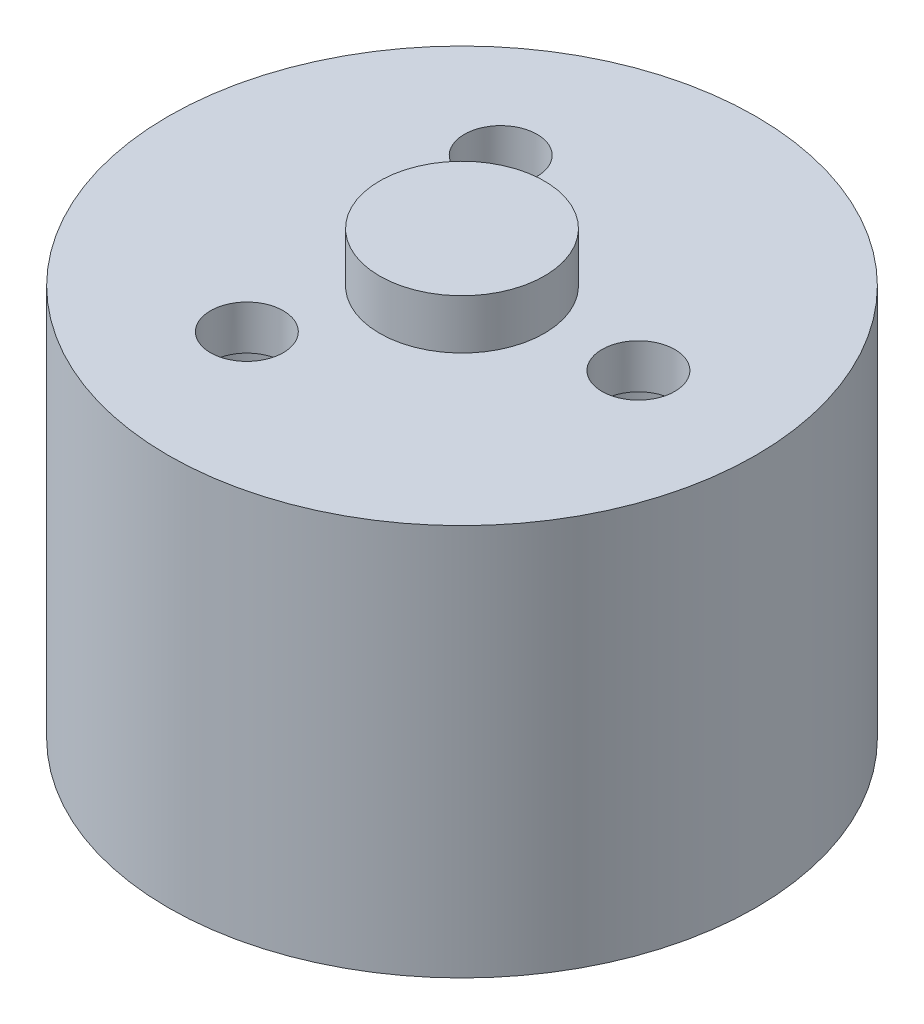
ISO-10303-21;
HEADER;
FILE_DESCRIPTION(('STEP AP214'),'2;1');
FILE_NAME('part.step','',(''),(''),'','','');
FILE_SCHEMA(('AUTOMOTIVE_DESIGN { 1 0 10303 214 1 1 1 1 }'));
ENDSEC;
DATA;
#1=APPLICATION_CONTEXT('core data for automotive mechanical design processes');
#2=APPLICATION_PROTOCOL_DEFINITION('international standard','automotive_design',2000,#1);
#3=PRODUCT_CONTEXT('',#1,'mechanical');
#4=PRODUCT('Part','Part','',(#3));
#5=PRODUCT_RELATED_PRODUCT_CATEGORY('part','',(#4));
#6=PRODUCT_DEFINITION_FORMATION('','',#4);
#7=PRODUCT_DEFINITION_CONTEXT('part definition',#1,'design');
#8=PRODUCT_DEFINITION('design','',#6,#7);
#9=PRODUCT_DEFINITION_SHAPE('','',#8);
#10=(LENGTH_UNIT() NAMED_UNIT(*) SI_UNIT(.MILLI.,.METRE.));
#11=(NAMED_UNIT(*) PLANE_ANGLE_UNIT() SI_UNIT($,.RADIAN.));
#12=(NAMED_UNIT(*) SI_UNIT($,.STERADIAN.) SOLID_ANGLE_UNIT());
#13=UNCERTAINTY_MEASURE_WITH_UNIT(LENGTH_MEASURE(1.E-05),#10,'distance_accuracy_value','');
#14=(GEOMETRIC_REPRESENTATION_CONTEXT(3) GLOBAL_UNCERTAINTY_ASSIGNED_CONTEXT((#13)) GLOBAL_UNIT_ASSIGNED_CONTEXT((#10,
#11,#12)) REPRESENTATION_CONTEXT('',''));
#15=CARTESIAN_POINT('',(0.,0.,0.));
#16=DIRECTION('',(0.,0.,1.));
#17=DIRECTION('',(1.,0.,0.));
#18=AXIS2_PLACEMENT_3D('',#15,#16,#17);
#19=CARTESIAN_POINT('',(0.,11.83716,0.));
#20=DIRECTION('',(0.,1.,0.));
#21=DIRECTION('',(0.,0.,1.));
#22=AXIS2_PLACEMENT_3D('',#19,#20,#21);
#23=PLANE('',#22);
#24=CARTESIAN_POINT('',(-2.83009570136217,11.83716,-4.0000697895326));
#25=DIRECTION('',(0.,1.,0.));
#26=DIRECTION('',(0.866025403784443,0.,-0.499999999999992));
#27=AXIS2_PLACEMENT_3D('',#24,#25,#26);
#28=CIRCLE('',#27,1.1);
#29=CARTESIAN_POINT('',(-1.87746775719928,11.83716,-4.55006978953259));
#30=VERTEX_POINT('',#29);
#31=EDGE_CURVE('E124',#30,#30,#28,.T.);
#32=ORIENTED_EDGE('',*,*,#31,.F.);
#33=EDGE_LOOP('',(#32));
#34=FACE_BOUND('',#33,.T.);
#35=CARTESIAN_POINT('',(-2.04911420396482,11.83716,4.45096966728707));
#36=DIRECTION('',(0.,1.,0.));
#37=DIRECTION('',(-0.866025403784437,0.,-0.500000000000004));
#38=AXIS2_PLACEMENT_3D('',#35,#36,#37);
#39=CIRCLE('',#38,1.1);
#40=CARTESIAN_POINT('',(-3.0017421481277,11.83716,3.90096966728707));
#41=VERTEX_POINT('',#40);
#42=EDGE_CURVE('E140',#41,#41,#39,.T.);
#43=ORIENTED_EDGE('',*,*,#42,.F.);
#44=EDGE_LOOP('',(#43));
#45=FACE_BOUND('',#44,.T.);
#46=CARTESIAN_POINT('',(4.87920990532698,11.83716,-0.45089987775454));
#47=DIRECTION('',(0.,1.,0.));
#48=DIRECTION('',(0.,0.,1.));
#49=AXIS2_PLACEMENT_3D('',#46,#47,#48);
#50=CIRCLE('',#49,1.1);
#51=CARTESIAN_POINT('',(4.87920990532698,11.83716,0.649100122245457));
#52=VERTEX_POINT('',#51);
#53=EDGE_CURVE('E48',#52,#52,#50,.T.);
#54=ORIENTED_EDGE('',*,*,#53,.F.);
#55=EDGE_LOOP('',(#54));
#56=FACE_BOUND('',#55,.T.);
#57=CARTESIAN_POINT('',(0.,11.83716,0.));
#58=DIRECTION('',(0.,1.,0.));
#59=DIRECTION('',(0.,0.,1.));
#60=AXIS2_PLACEMENT_3D('',#57,#58,#59);
#61=CIRCLE('',#60,8.875);
#62=CARTESIAN_POINT('',(0.,11.83716,-8.875));
#63=VERTEX_POINT('',#62);
#64=EDGE_CURVE('E11',#63,#63,#61,.T.);
#65=ORIENTED_EDGE('',*,*,#64,.T.);
#66=EDGE_LOOP('',(#65));
#67=FACE_BOUND('',#66,.T.);
#68=CARTESIAN_POINT('',(0.,11.83716,0.));
#69=DIRECTION('',(0.,1.,0.));
#70=DIRECTION('',(0.,0.,1.));
#71=AXIS2_PLACEMENT_3D('',#68,#69,#70);
#72=CIRCLE('',#71,2.4892);
#73=CARTESIAN_POINT('',(0.,11.83716,2.4892));
#74=VERTEX_POINT('',#73);
#75=EDGE_CURVE('E168',#74,#74,#72,.T.);
#76=ORIENTED_EDGE('',*,*,#75,.F.);
#77=EDGE_LOOP('',(#76));
#78=FACE_BOUND('',#77,.T.);
#79=ADVANCED_FACE('F44',(#34,#45,#56,#67,#78),#23,.T.);
#80=CARTESIAN_POINT('',(0.,11.83716,0.));
#81=DIRECTION('',(0.,-1.,0.));
#82=DIRECTION('',(0.,0.,-1.));
#83=AXIS2_PLACEMENT_3D('',#80,#81,#82);
#84=CYLINDRICAL_SURFACE('',#83,8.875);
#85=CARTESIAN_POINT('',(0.,0.,0.));
#86=DIRECTION('',(0.,1.,0.));
#87=DIRECTION('',(0.,0.,1.));
#88=AXIS2_PLACEMENT_3D('',#85,#86,#87);
#89=CIRCLE('',#88,8.875);
#90=CARTESIAN_POINT('',(0.,0.,-8.875));
#91=VERTEX_POINT('',#90);
#92=EDGE_CURVE('E54',#91,#91,#89,.T.);
#93=CARTESIAN_POINT('',(0.,11.83716,-8.875));
#94=CARTESIAN_POINT('',(0.,11.71385625,-8.875));
#95=CARTESIAN_POINT('',(0.,11.5905525,-8.875));
#96=CARTESIAN_POINT('',(0.,11.343945,-8.875));
#97=CARTESIAN_POINT('',(0.,11.22064125,-8.875));
#98=CARTESIAN_POINT('',(0.,10.97403375,-8.875));
#99=CARTESIAN_POINT('',(0.,10.85073,-8.875));
#100=CARTESIAN_POINT('',(0.,10.6041225,-8.875));
#101=CARTESIAN_POINT('',(0.,10.48081875,-8.875));
#102=CARTESIAN_POINT('',(0.,10.23421125,-8.875));
#103=CARTESIAN_POINT('',(0.,10.1109075,-8.875));
#104=CARTESIAN_POINT('',(0.,9.8643,-8.875));
#105=CARTESIAN_POINT('',(0.,9.74099625,-8.875));
#106=CARTESIAN_POINT('',(0.,9.49438875,-8.875));
#107=CARTESIAN_POINT('',(0.,9.371085,-8.875));
#108=CARTESIAN_POINT('',(0.,9.1244775,-8.875));
#109=CARTESIAN_POINT('',(0.,9.00117375,-8.875));
#110=CARTESIAN_POINT('',(0.,8.75456625,-8.875));
#111=CARTESIAN_POINT('',(0.,8.6312625,-8.875));
#112=CARTESIAN_POINT('',(0.,8.384655,-8.875));
#113=CARTESIAN_POINT('',(0.,8.26135125,-8.875));
#114=CARTESIAN_POINT('',(0.,8.01474375,-8.875));
#115=CARTESIAN_POINT('',(0.,7.89144,-8.875));
#116=CARTESIAN_POINT('',(0.,7.6448325,-8.875));
#117=CARTESIAN_POINT('',(0.,7.52152875,-8.875));
#118=CARTESIAN_POINT('',(0.,7.27492125,-8.875));
#119=CARTESIAN_POINT('',(0.,7.1516175,-8.875));
#120=CARTESIAN_POINT('',(0.,6.90501,-8.875));
#121=CARTESIAN_POINT('',(0.,6.78170625,-8.875));
#122=CARTESIAN_POINT('',(0.,6.53509875,-8.875));
#123=CARTESIAN_POINT('',(0.,6.411795,-8.875));
#124=CARTESIAN_POINT('',(0.,6.1651875,-8.875));
#125=CARTESIAN_POINT('',(0.,6.04188375,-8.875));
#126=CARTESIAN_POINT('',(0.,5.79527625,-8.875));
#127=CARTESIAN_POINT('',(0.,5.6719725,-8.875));
#128=CARTESIAN_POINT('',(0.,5.425365,-8.875));
#129=CARTESIAN_POINT('',(0.,5.30206125,-8.875));
#130=CARTESIAN_POINT('',(0.,5.05545375,-8.875));
#131=CARTESIAN_POINT('',(0.,4.93215,-8.875));
#132=CARTESIAN_POINT('',(0.,4.6855425,-8.875));
#133=CARTESIAN_POINT('',(0.,4.56223875,-8.875));
#134=CARTESIAN_POINT('',(0.,4.31563125,-8.875));
#135=CARTESIAN_POINT('',(0.,4.1923275,-8.875));
#136=CARTESIAN_POINT('',(0.,3.94572,-8.875));
#137=CARTESIAN_POINT('',(0.,3.82241625,-8.875));
#138=CARTESIAN_POINT('',(0.,3.57580875,-8.875));
#139=CARTESIAN_POINT('',(0.,3.452505,-8.875));
#140=CARTESIAN_POINT('',(0.,3.2058975,-8.875));
#141=CARTESIAN_POINT('',(0.,3.08259375,-8.875));
#142=CARTESIAN_POINT('',(0.,2.83598625,-8.875));
#143=CARTESIAN_POINT('',(0.,2.7126825,-8.875));
#144=CARTESIAN_POINT('',(0.,2.466075,-8.875));
#145=CARTESIAN_POINT('',(0.,2.34277125,-8.875));
#146=CARTESIAN_POINT('',(0.,2.09616375,-8.875));
#147=CARTESIAN_POINT('',(0.,1.97286,-8.875));
#148=CARTESIAN_POINT('',(0.,1.7262525,-8.875));
#149=CARTESIAN_POINT('',(0.,1.60294875,-8.875));
#150=CARTESIAN_POINT('',(0.,1.35634125,-8.875));
#151=CARTESIAN_POINT('',(0.,1.2330375,-8.875));
#152=CARTESIAN_POINT('',(0.,0.986429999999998,-8.875));
#153=CARTESIAN_POINT('',(0.,0.863126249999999,-8.875));
#154=CARTESIAN_POINT('',(0.,0.616518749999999,-8.875));
#155=CARTESIAN_POINT('',(0.,0.493214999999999,-8.875));
#156=CARTESIAN_POINT('',(0.,0.246607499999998,-8.875));
#157=CARTESIAN_POINT('',(0.,0.123303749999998,-8.875));
#158=CARTESIAN_POINT('',(0.,0.,-8.875));
#159=B_SPLINE_CURVE_WITH_KNOTS('',3,(#93,#94,#95,#96,#97,#98,#99,#100,#101,#102,#103,#104,#105,
#106,#107,#108,#109,#110,#111,#112,#113,#114,#115,#116,#117,#118,#119,#120,#121,#122,#123,#124,
#125,#126,#127,#128,#129,#130,#131,#132,#133,#134,#135,#136,#137,#138,#139,#140,#141,#142,#143,
#144,#145,#146,#147,#148,#149,#150,#151,#152,#153,#154,#155,#156,#157,#158),.UNSPECIFIED.,.F.,
.F.,(4,2,2,2,2,2,2,2,2,2,2,2,2,2,2,2,2,2,2,2,2,2,2,2,2,2,2,2,2,2,2,2,4),(0.,0.36991125,
0.739822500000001,1.10973375,1.479645,1.84955625,2.2194675,2.58937875,2.95929,3.32920125,
3.6991125,4.06902375,4.438935,4.80884625,5.1787575,5.54866875,5.91858,6.28849125,6.6584025,
7.02831375,7.398225,7.76813625,8.1380475,8.50795875,8.87787,9.24778125,9.6176925,9.98760375,
10.357515,10.72742625,11.0973375,11.46724875,11.83716),.UNSPECIFIED.);
#160=EDGE_CURVE('BSEAM46',#63,#91,#159,.T.);
#161=ORIENTED_EDGE('',*,*,#64,.F.);
#162=ORIENTED_EDGE('',*,*,#92,.T.);
#163=ORIENTED_EDGE('',*,*,#160,.T.);
#164=ORIENTED_EDGE('',*,*,#160,.F.);
#165=EDGE_LOOP('',(#161,#163,#162,#164));
#166=FACE_BOUND('',#165,.T.);
#167=ADVANCED_FACE('F46',(#166),#84,.T.);
#168=CARTESIAN_POINT('',(0.,0.,0.));
#169=DIRECTION('',(0.,1.,0.));
#170=DIRECTION('',(0.,0.,1.));
#171=AXIS2_PLACEMENT_3D('',#168,#169,#170);
#172=PLANE('',#171);
#173=CARTESIAN_POINT('',(2.04911420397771,0.,-4.45096966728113));
#174=DIRECTION('',(0.,-1.,0.));
#175=DIRECTION('',(-0.866025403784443,0.,0.499999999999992));
#176=AXIS2_PLACEMENT_3D('',#173,#174,#175);
#177=CIRCLE('',#176,1.);
#178=CARTESIAN_POINT('',(1.18308880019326,0.,-3.95096966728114));
#179=VERTEX_POINT('',#178);
#180=EDGE_CURVE('E297',#179,#179,#177,.T.);
#181=ORIENTED_EDGE('',*,*,#180,.F.);
#182=EDGE_LOOP('',(#181));
#183=FACE_BOUND('',#182,.T.);
#184=CARTESIAN_POINT('',(-4.87920990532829,0.,0.450899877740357));
#185=DIRECTION('',(0.,-1.,0.));
#186=DIRECTION('',(0.866025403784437,0.,0.500000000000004));
#187=AXIS2_PLACEMENT_3D('',#184,#185,#186);
#188=CIRCLE('',#187,1.);
#189=CARTESIAN_POINT('',(-4.01318450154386,0.,0.950899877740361));
#190=VERTEX_POINT('',#189);
#191=EDGE_CURVE('E79',#190,#190,#188,.T.);
#192=ORIENTED_EDGE('',*,*,#191,.F.);
#193=EDGE_LOOP('',(#192));
#194=FACE_BOUND('',#193,.T.);
#195=CARTESIAN_POINT('',(2.83009570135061,0.,4.00006978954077));
#196=DIRECTION('',(0.,-1.,0.));
#197=DIRECTION('',(0.,0.,-1.));
#198=AXIS2_PLACEMENT_3D('',#195,#196,#197);
#199=CIRCLE('',#198,1.);
#200=CARTESIAN_POINT('',(2.83009570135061,0.,3.00006978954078));
#201=VERTEX_POINT('',#200);
#202=EDGE_CURVE('E104',#201,#201,#199,.T.);
#203=ORIENTED_EDGE('',*,*,#202,.F.);
#204=EDGE_LOOP('',(#203));
#205=FACE_BOUND('',#204,.T.);
#206=CARTESIAN_POINT('',(-2.83009570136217,0.,-4.00006978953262));
#207=DIRECTION('',(0.,-1.,0.));
#208=DIRECTION('',(-0.866025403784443,0.,0.499999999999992));
#209=AXIS2_PLACEMENT_3D('',#206,#207,#208);
#210=CIRCLE('',#209,2.19999999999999);
#211=CARTESIAN_POINT('',(-4.73535158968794,0.,-2.90006978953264));
#212=VERTEX_POINT('',#211);
#213=EDGE_CURVE('E120',#212,#212,#210,.T.);
#214=ORIENTED_EDGE('',*,*,#213,.F.);
#215=EDGE_LOOP('',(#214));
#216=FACE_BOUND('',#215,.T.);
#217=CARTESIAN_POINT('',(-2.04911420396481,0.,4.45096966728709));
#218=DIRECTION('',(0.,-1.,0.));
#219=DIRECTION('',(0.866025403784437,0.,0.500000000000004));
#220=AXIS2_PLACEMENT_3D('',#217,#218,#219);
#221=CIRCLE('',#220,2.19999999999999);
#222=CARTESIAN_POINT('',(-0.143858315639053,0.,5.55096966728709));
#223=VERTEX_POINT('',#222);
#224=EDGE_CURVE('E136',#223,#223,#221,.T.);
#225=ORIENTED_EDGE('',*,*,#224,.F.);
#226=EDGE_LOOP('',(#225));
#227=FACE_BOUND('',#226,.T.);
#228=CARTESIAN_POINT('',(4.87920990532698,0.,-0.450899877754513));
#229=DIRECTION('',(0.,-1.,0.));
#230=DIRECTION('',(0.,0.,-1.));
#231=AXIS2_PLACEMENT_3D('',#228,#229,#230);
#232=CIRCLE('',#231,2.19999999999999);
#233=CARTESIAN_POINT('',(4.87920990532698,0.,-2.65089987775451));
#234=VERTEX_POINT('',#233);
#235=EDGE_CURVE('E152',#234,#234,#232,.T.);
#236=ORIENTED_EDGE('',*,*,#235,.F.);
#237=EDGE_LOOP('',(#236));
#238=FACE_BOUND('',#237,.T.);
#239=CARTESIAN_POINT('',(0.,0.,0.));
#240=DIRECTION('',(0.,-1.,0.));
#241=DIRECTION('',(0.,0.,-1.));
#242=AXIS2_PLACEMENT_3D('',#239,#240,#241);
#243=CIRCLE('',#242,2.4892);
#244=CARTESIAN_POINT('',(0.,0.,-2.4892));
#245=VERTEX_POINT('',#244);
#246=EDGE_CURVE('E169',#245,#245,#243,.T.);
#247=ORIENTED_EDGE('',*,*,#246,.F.);
#248=EDGE_LOOP('',(#247));
#249=FACE_BOUND('',#248,.T.);
#250=ORIENTED_EDGE('',*,*,#92,.F.);
#251=EDGE_LOOP('',(#250));
#252=FACE_BOUND('',#251,.T.);
#253=ADVANCED_FACE('F184',(#183,#194,#205,#216,#227,#238,#249,#252),#172,.F.);
#254=CARTESIAN_POINT('',(0.,13.33716,0.));
#255=DIRECTION('',(0.,-1.,0.));
#256=DIRECTION('',(0.,0.,-1.));
#257=AXIS2_PLACEMENT_3D('',#254,#255,#256);
#258=CYLINDRICAL_SURFACE('',#257,2.4892);
#259=CARTESIAN_POINT('',(0.,13.33716,0.));
#260=DIRECTION('',(0.,1.,0.));
#261=DIRECTION('',(0.,0.,1.));
#262=AXIS2_PLACEMENT_3D('',#259,#260,#261);
#263=CIRCLE('',#262,2.4892);
#264=CARTESIAN_POINT('',(0.,13.33716,2.4892));
#265=VERTEX_POINT('',#264);
#266=EDGE_CURVE('E173',#265,#265,#263,.T.);
#267=ORIENTED_EDGE('',*,*,#266,.F.);
#268=EDGE_LOOP('',(#267));
#269=FACE_BOUND('',#268,.T.);
#270=ORIENTED_EDGE('',*,*,#75,.T.);
#271=EDGE_LOOP('',(#270));
#272=FACE_BOUND('',#271,.T.);
#273=ADVANCED_FACE('F186',(#269,#272),#258,.T.);
#274=CARTESIAN_POINT('',(0.,13.33716,0.));
#275=DIRECTION('',(0.,1.,0.));
#276=DIRECTION('',(0.,0.,1.));
#277=AXIS2_PLACEMENT_3D('',#274,#275,#276);
#278=PLANE('',#277);
#279=ORIENTED_EDGE('',*,*,#266,.T.);
#280=EDGE_LOOP('',(#279));
#281=FACE_BOUND('',#280,.T.);
#282=ADVANCED_FACE('F192',(#281),#278,.T.);
#283=CARTESIAN_POINT('',(0.,1.5,0.));
#284=DIRECTION('',(0.,-1.,0.));
#285=DIRECTION('',(0.,0.,-1.));
#286=AXIS2_PLACEMENT_3D('',#283,#284,#285);
#287=CYLINDRICAL_SURFACE('',#286,2.4892);
#288=CARTESIAN_POINT('',(0.,1.5,0.));
#289=DIRECTION('',(0.,-1.,0.));
#290=DIRECTION('',(0.,0.,-1.));
#291=AXIS2_PLACEMENT_3D('',#288,#289,#290);
#292=CIRCLE('',#291,2.4892);
#293=CARTESIAN_POINT('',(0.,1.5,-2.48920000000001));
#294=VERTEX_POINT('',#293);
#295=EDGE_CURVE('E164',#294,#294,#292,.T.);
#296=ORIENTED_EDGE('',*,*,#295,.F.);
#297=EDGE_LOOP('',(#296));
#298=FACE_BOUND('',#297,.T.);
#299=ORIENTED_EDGE('',*,*,#246,.T.);
#300=EDGE_LOOP('',(#299));
#301=FACE_BOUND('',#300,.T.);
#302=ADVANCED_FACE('F208',(#298,#301),#287,.F.);
#303=CARTESIAN_POINT('',(0.,1.5,0.));
#304=DIRECTION('',(0.,-1.,0.));
#305=DIRECTION('',(0.,0.,-1.));
#306=AXIS2_PLACEMENT_3D('',#303,#304,#305);
#307=PLANE('',#306);
#308=ORIENTED_EDGE('',*,*,#295,.T.);
#309=EDGE_LOOP('',(#308));
#310=FACE_BOUND('',#309,.T.);
#311=ADVANCED_FACE('F212',(#310),#307,.T.);
#312=CARTESIAN_POINT('',(4.87920990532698,0.,-0.450899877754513));
#313=DIRECTION('',(0.,-1.,0.));
#314=DIRECTION('',(0.,0.,-1.));
#315=AXIS2_PLACEMENT_3D('',#312,#313,#314);
#316=CYLINDRICAL_SURFACE('',#315,1.1);
#317=ORIENTED_EDGE('',*,*,#53,.T.);
#318=EDGE_LOOP('',(#317));
#319=FACE_BOUND('',#318,.T.);
#320=CARTESIAN_POINT('',(4.87920990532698,10.5,-0.45089987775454));
#321=DIRECTION('',(0.,-1.,0.));
#322=DIRECTION('',(0.,0.,-1.));
#323=AXIS2_PLACEMENT_3D('',#320,#321,#322);
#324=CIRCLE('',#323,1.1);
#325=CARTESIAN_POINT('',(4.87920990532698,10.5,-1.55089987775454));
#326=VERTEX_POINT('',#325);
#327=EDGE_CURVE('E160',#326,#326,#324,.T.);
#328=ORIENTED_EDGE('',*,*,#327,.T.);
#329=EDGE_LOOP('',(#328));
#330=FACE_BOUND('',#329,.T.);
#331=ADVANCED_FACE('F216',(#319,#330),#316,.F.);
#332=CARTESIAN_POINT('',(5.97920990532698,10.5,-0.45089987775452));
#333=DIRECTION('',(0.,1.,0.));
#334=DIRECTION('',(0.,0.,1.));
#335=AXIS2_PLACEMENT_3D('',#332,#333,#334);
#336=PLANE('',#335);
#337=ORIENTED_EDGE('',*,*,#327,.F.);
#338=EDGE_LOOP('',(#337));
#339=FACE_BOUND('',#338,.T.);
#340=CARTESIAN_POINT('',(4.87920990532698,10.5,-0.45089987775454));
#341=DIRECTION('',(0.,-1.,0.));
#342=DIRECTION('',(0.,0.,-1.));
#343=AXIS2_PLACEMENT_3D('',#340,#341,#342);
#344=CIRCLE('',#343,2.2);
#345=CARTESIAN_POINT('',(4.87920990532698,10.5,-2.65089987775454));
#346=VERTEX_POINT('',#345);
#347=EDGE_CURVE('E156',#346,#346,#344,.T.);
#348=ORIENTED_EDGE('',*,*,#347,.T.);
#349=EDGE_LOOP('',(#348));
#350=FACE_BOUND('',#349,.T.);
#351=ADVANCED_FACE('F220',(#339,#350),#336,.F.);
#352=CARTESIAN_POINT('',(4.87920990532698,0.,-0.450899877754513));
#353=DIRECTION('',(0.,-1.,0.));
#354=DIRECTION('',(0.,0.,-1.));
#355=AXIS2_PLACEMENT_3D('',#352,#353,#354);
#356=CYLINDRICAL_SURFACE('',#355,2.2);
#357=ORIENTED_EDGE('',*,*,#347,.F.);
#358=EDGE_LOOP('',(#357));
#359=FACE_BOUND('',#358,.T.);
#360=ORIENTED_EDGE('',*,*,#235,.T.);
#361=EDGE_LOOP('',(#360));
#362=FACE_BOUND('',#361,.T.);
#363=ADVANCED_FACE('F224',(#359,#362),#356,.F.);
#364=CARTESIAN_POINT('',(-2.04911420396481,0.,4.45096966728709));
#365=DIRECTION('',(0.,-1.,0.));
#366=DIRECTION('',(0.866025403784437,0.,0.500000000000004));
#367=AXIS2_PLACEMENT_3D('',#364,#365,#366);
#368=CYLINDRICAL_SURFACE('',#367,1.1);
#369=ORIENTED_EDGE('',*,*,#42,.T.);
#370=EDGE_LOOP('',(#369));
#371=FACE_BOUND('',#370,.T.);
#372=CARTESIAN_POINT('',(-2.04911420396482,10.5,4.45096966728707));
#373=DIRECTION('',(0.,-1.,0.));
#374=DIRECTION('',(0.866025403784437,0.,0.500000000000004));
#375=AXIS2_PLACEMENT_3D('',#372,#373,#374);
#376=CIRCLE('',#375,1.1);
#377=CARTESIAN_POINT('',(-1.09648625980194,10.5,5.00096966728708));
#378=VERTEX_POINT('',#377);
#379=EDGE_CURVE('E148',#378,#378,#376,.T.);
#380=ORIENTED_EDGE('',*,*,#379,.T.);
#381=EDGE_LOOP('',(#380));
#382=FACE_BOUND('',#381,.T.);
#383=ADVANCED_FACE('F228',(#371,#382),#368,.F.);
#384=CARTESIAN_POINT('',(-2.59911420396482,10.5,5.40359761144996));
#385=DIRECTION('',(0.,1.,0.));
#386=DIRECTION('',(-0.866025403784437,0.,-0.500000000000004));
#387=AXIS2_PLACEMENT_3D('',#384,#385,#386);
#388=PLANE('',#387);
#389=ORIENTED_EDGE('',*,*,#379,.F.);
#390=EDGE_LOOP('',(#389));
#391=FACE_BOUND('',#390,.T.);
#392=CARTESIAN_POINT('',(-2.04911420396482,10.5,4.45096966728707));
#393=DIRECTION('',(0.,-1.,0.));
#394=DIRECTION('',(0.866025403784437,0.,0.500000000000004));
#395=AXIS2_PLACEMENT_3D('',#392,#393,#394);
#396=CIRCLE('',#395,2.2);
#397=CARTESIAN_POINT('',(-0.143858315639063,10.5,5.55096966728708));
#398=VERTEX_POINT('',#397);
#399=EDGE_CURVE('E144',#398,#398,#396,.T.);
#400=ORIENTED_EDGE('',*,*,#399,.T.);
#401=EDGE_LOOP('',(#400));
#402=FACE_BOUND('',#401,.T.);
#403=ADVANCED_FACE('F233',(#391,#402),#388,.F.);
#404=CARTESIAN_POINT('',(-2.04911420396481,0.,4.45096966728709));
#405=DIRECTION('',(0.,-1.,0.));
#406=DIRECTION('',(0.866025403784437,0.,0.500000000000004));
#407=AXIS2_PLACEMENT_3D('',#404,#405,#406);
#408=CYLINDRICAL_SURFACE('',#407,2.2);
#409=ORIENTED_EDGE('',*,*,#399,.F.);
#410=EDGE_LOOP('',(#409));
#411=FACE_BOUND('',#410,.T.);
#412=ORIENTED_EDGE('',*,*,#224,.T.);
#413=EDGE_LOOP('',(#412));
#414=FACE_BOUND('',#413,.T.);
#415=ADVANCED_FACE('F230',(#411,#414),#408,.F.);
#416=CARTESIAN_POINT('',(-2.83009570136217,0.,-4.00006978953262));
#417=DIRECTION('',(0.,-1.,0.));
#418=DIRECTION('',(-0.866025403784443,0.,0.499999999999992));
#419=AXIS2_PLACEMENT_3D('',#416,#417,#418);
#420=CYLINDRICAL_SURFACE('',#419,1.1);
#421=ORIENTED_EDGE('',*,*,#31,.T.);
#422=EDGE_LOOP('',(#421));
#423=FACE_BOUND('',#422,.T.);
#424=CARTESIAN_POINT('',(-2.83009570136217,10.5,-4.0000697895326));
#425=DIRECTION('',(0.,-1.,0.));
#426=DIRECTION('',(-0.866025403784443,0.,0.499999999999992));
#427=AXIS2_PLACEMENT_3D('',#424,#425,#426);
#428=CIRCLE('',#427,1.1);
#429=CARTESIAN_POINT('',(-3.78272364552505,10.5,-3.45006978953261));
#430=VERTEX_POINT('',#429);
#431=EDGE_CURVE('E132',#430,#430,#428,.T.);
#432=ORIENTED_EDGE('',*,*,#431,.T.);
#433=EDGE_LOOP('',(#432));
#434=FACE_BOUND('',#433,.T.);
#435=ADVANCED_FACE('F241',(#423,#434),#420,.F.);
#436=CARTESIAN_POINT('',(-3.38009570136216,10.5,-4.95269773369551));
#437=DIRECTION('',(0.,1.,0.));
#438=DIRECTION('',(0.866025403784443,0.,-0.499999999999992));
#439=AXIS2_PLACEMENT_3D('',#436,#437,#438);
#440=PLANE('',#439);
#441=ORIENTED_EDGE('',*,*,#431,.F.);
#442=EDGE_LOOP('',(#441));
#443=FACE_BOUND('',#442,.T.);
#444=CARTESIAN_POINT('',(-2.83009570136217,10.5,-4.0000697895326));
#445=DIRECTION('',(0.,-1.,0.));
#446=DIRECTION('',(-0.866025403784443,0.,0.499999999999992));
#447=AXIS2_PLACEMENT_3D('',#444,#445,#446);
#448=CIRCLE('',#447,2.2);
#449=CARTESIAN_POINT('',(-4.73535158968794,10.5,-2.90006978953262));
#450=VERTEX_POINT('',#449);
#451=EDGE_CURVE('E128',#450,#450,#448,.T.);
#452=ORIENTED_EDGE('',*,*,#451,.T.);
#453=EDGE_LOOP('',(#452));
#454=FACE_BOUND('',#453,.T.);
#455=ADVANCED_FACE('F245',(#443,#454),#440,.F.);
#456=CARTESIAN_POINT('',(-2.83009570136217,0.,-4.00006978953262));
#457=DIRECTION('',(0.,-1.,0.));
#458=DIRECTION('',(-0.866025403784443,0.,0.499999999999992));
#459=AXIS2_PLACEMENT_3D('',#456,#457,#458);
#460=CYLINDRICAL_SURFACE('',#459,2.2);
#461=ORIENTED_EDGE('',*,*,#451,.F.);
#462=EDGE_LOOP('',(#461));
#463=FACE_BOUND('',#462,.T.);
#464=ORIENTED_EDGE('',*,*,#213,.T.);
#465=EDGE_LOOP('',(#464));
#466=FACE_BOUND('',#465,.T.);
#467=ADVANCED_FACE('F235',(#463,#466),#460,.F.);
#468=CARTESIAN_POINT('',(2.83009570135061,6.2,4.00006978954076));
#469=DIRECTION('',(0.,-1.,0.));
#470=DIRECTION('',(0.,0.,-1.));
#471=AXIS2_PLACEMENT_3D('',#468,#469,#470);
#472=CONICAL_SURFACE('',#471,0.799999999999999,1.02974425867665);
#473=CARTESIAN_POINT('',(2.83009570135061,6.68068849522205,4.00006978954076));
#474=VERTEX_POINT('',#473);
#475=VERTEX_LOOP('',#474);
#476=FACE_BOUND('',#475,.T.);
#477=CARTESIAN_POINT('',(2.83009570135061,6.2,4.00006978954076));
#478=DIRECTION('',(0.,-1.,0.));
#479=DIRECTION('',(0.,0.,-1.));
#480=AXIS2_PLACEMENT_3D('',#477,#478,#479);
#481=CIRCLE('',#480,0.799999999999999);
#482=CARTESIAN_POINT('',(2.83009570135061,6.2,3.20006978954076));
#483=VERTEX_POINT('',#482);
#484=EDGE_CURVE('E116',#483,#483,#481,.T.);
#485=ORIENTED_EDGE('',*,*,#484,.T.);
#486=EDGE_LOOP('',(#485));
#487=FACE_BOUND('',#486,.T.);
#488=ADVANCED_FACE('F247',(#476,#487),#472,.F.);
#489=CARTESIAN_POINT('',(2.83009570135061,0.,4.00006978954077));
#490=DIRECTION('',(0.,-1.,0.));
#491=DIRECTION('',(0.,0.,-1.));
#492=AXIS2_PLACEMENT_3D('',#489,#490,#491);
#493=CYLINDRICAL_SURFACE('',#492,0.799999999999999);
#494=ORIENTED_EDGE('',*,*,#484,.F.);
#495=EDGE_LOOP('',(#494));
#496=FACE_BOUND('',#495,.T.);
#497=CARTESIAN_POINT('',(2.83009570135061,5.,4.00006978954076));
#498=DIRECTION('',(0.,-1.,0.));
#499=DIRECTION('',(0.,0.,-1.));
#500=AXIS2_PLACEMENT_3D('',#497,#498,#499);
#501=CIRCLE('',#500,0.799999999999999);
#502=CARTESIAN_POINT('',(2.83009570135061,5.,3.20006978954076));
#503=VERTEX_POINT('',#502);
#504=EDGE_CURVE('E112',#503,#503,#501,.T.);
#505=ORIENTED_EDGE('',*,*,#504,.T.);
#506=EDGE_LOOP('',(#505));
#507=FACE_BOUND('',#506,.T.);
#508=ADVANCED_FACE('F256',(#496,#507),#493,.F.);
#509=CARTESIAN_POINT('',(3.63009570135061,5.,4.00006978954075));
#510=DIRECTION('',(0.,1.,0.));
#511=DIRECTION('',(0.,0.,1.));
#512=AXIS2_PLACEMENT_3D('',#509,#510,#511);
#513=PLANE('',#512);
#514=ORIENTED_EDGE('',*,*,#504,.F.);
#515=EDGE_LOOP('',(#514));
#516=FACE_BOUND('',#515,.T.);
#517=CARTESIAN_POINT('',(2.83009570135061,5.,4.00006978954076));
#518=DIRECTION('',(0.,-1.,0.));
#519=DIRECTION('',(0.,0.,-1.));
#520=AXIS2_PLACEMENT_3D('',#517,#518,#519);
#521=CIRCLE('',#520,0.999999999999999);
#522=CARTESIAN_POINT('',(2.83009570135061,5.,3.00006978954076));
#523=VERTEX_POINT('',#522);
#524=EDGE_CURVE('E108',#523,#523,#521,.T.);
#525=ORIENTED_EDGE('',*,*,#524,.T.);
#526=EDGE_LOOP('',(#525));
#527=FACE_BOUND('',#526,.T.);
#528=ADVANCED_FACE('F259',(#516,#527),#513,.F.);
#529=CARTESIAN_POINT('',(2.83009570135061,0.,4.00006978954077));
#530=DIRECTION('',(0.,-1.,0.));
#531=DIRECTION('',(0.,0.,-1.));
#532=AXIS2_PLACEMENT_3D('',#529,#530,#531);
#533=CYLINDRICAL_SURFACE('',#532,0.999999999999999);
#534=ORIENTED_EDGE('',*,*,#524,.F.);
#535=EDGE_LOOP('',(#534));
#536=FACE_BOUND('',#535,.T.);
#537=ORIENTED_EDGE('',*,*,#202,.T.);
#538=EDGE_LOOP('',(#537));
#539=FACE_BOUND('',#538,.T.);
#540=ADVANCED_FACE('F263',(#536,#539),#533,.F.);
#541=CARTESIAN_POINT('',(-4.87920990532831,6.2,0.450899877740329));
#542=DIRECTION('',(0.,-1.,0.));
#543=DIRECTION('',(0.866025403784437,0.,0.500000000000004));
#544=AXIS2_PLACEMENT_3D('',#541,#542,#543);
#545=CONICAL_SURFACE('',#544,0.799999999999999,1.02974425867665);
#546=CARTESIAN_POINT('',(-4.87920990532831,6.68068849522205,0.450899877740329));
#547=VERTEX_POINT('',#546);
#548=VERTEX_LOOP('',#547);
#549=FACE_BOUND('',#548,.T.);
#550=CARTESIAN_POINT('',(-4.87920990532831,6.2,0.450899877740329));
#551=DIRECTION('',(0.,-1.,0.));
#552=DIRECTION('',(0.866025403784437,0.,0.500000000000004));
#553=AXIS2_PLACEMENT_3D('',#550,#551,#552);
#554=CIRCLE('',#553,0.799999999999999);
#555=CARTESIAN_POINT('',(-4.18638958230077,6.2,0.850899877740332));
#556=VERTEX_POINT('',#555);
#557=EDGE_CURVE('E100',#556,#556,#554,.T.);
#558=ORIENTED_EDGE('',*,*,#557,.T.);
#559=EDGE_LOOP('',(#558));
#560=FACE_BOUND('',#559,.T.);
#561=ADVANCED_FACE('F267',(#549,#560),#545,.F.);
#562=CARTESIAN_POINT('',(-4.87920990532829,0.,0.450899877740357));
#563=DIRECTION('',(0.,-1.,0.));
#564=DIRECTION('',(0.866025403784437,0.,0.500000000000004));
#565=AXIS2_PLACEMENT_3D('',#562,#563,#564);
#566=CYLINDRICAL_SURFACE('',#565,0.799999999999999);
#567=ORIENTED_EDGE('',*,*,#557,.F.);
#568=EDGE_LOOP('',(#567));
#569=FACE_BOUND('',#568,.T.);
#570=CARTESIAN_POINT('',(-4.87920990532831,5.,0.450899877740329));
#571=DIRECTION('',(0.,-1.,0.));
#572=DIRECTION('',(0.866025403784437,0.,0.500000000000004));
#573=AXIS2_PLACEMENT_3D('',#570,#571,#572);
#574=CIRCLE('',#573,0.799999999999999);
#575=CARTESIAN_POINT('',(-4.18638958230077,5.,0.850899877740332));
#576=VERTEX_POINT('',#575);
#577=EDGE_CURVE('E96',#576,#576,#574,.T.);
#578=ORIENTED_EDGE('',*,*,#577,.T.);
#579=EDGE_LOOP('',(#578));
#580=FACE_BOUND('',#579,.T.);
#581=ADVANCED_FACE('F271',(#569,#580),#566,.F.);
#582=CARTESIAN_POINT('',(-5.27920990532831,5.,1.1437202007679));
#583=DIRECTION('',(0.,1.,0.));
#584=DIRECTION('',(-0.866025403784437,0.,-0.500000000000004));
#585=AXIS2_PLACEMENT_3D('',#582,#583,#584);
#586=PLANE('',#585);
#587=ORIENTED_EDGE('',*,*,#577,.F.);
#588=EDGE_LOOP('',(#587));
#589=FACE_BOUND('',#588,.T.);
#590=CARTESIAN_POINT('',(-4.87920990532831,5.,0.450899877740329));
#591=DIRECTION('',(0.,-1.,0.));
#592=DIRECTION('',(0.866025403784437,0.,0.500000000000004));
#593=AXIS2_PLACEMENT_3D('',#590,#591,#592);
#594=CIRCLE('',#593,0.999999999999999);
#595=CARTESIAN_POINT('',(-4.01318450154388,5.,0.950899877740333));
#596=VERTEX_POINT('',#595);
#597=EDGE_CURVE('E86',#596,#596,#594,.T.);
#598=ORIENTED_EDGE('',*,*,#597,.T.);
#599=EDGE_LOOP('',(#598));
#600=FACE_BOUND('',#599,.T.);
#601=ADVANCED_FACE('F275',(#589,#600),#586,.F.);
#602=CARTESIAN_POINT('',(-4.87920990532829,0.,0.450899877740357));
#603=DIRECTION('',(0.,-1.,0.));
#604=DIRECTION('',(0.866025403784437,0.,0.500000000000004));
#605=AXIS2_PLACEMENT_3D('',#602,#603,#604);
#606=CYLINDRICAL_SURFACE('',#605,0.999999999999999);
#607=ORIENTED_EDGE('',*,*,#597,.F.);
#608=EDGE_LOOP('',(#607));
#609=FACE_BOUND('',#608,.T.);
#610=ORIENTED_EDGE('',*,*,#191,.T.);
#611=EDGE_LOOP('',(#610));
#612=FACE_BOUND('',#611,.T.);
#613=ADVANCED_FACE('F72',(#609,#612),#606,.F.);
#614=CARTESIAN_POINT('',(2.04911420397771,6.2,-4.45096966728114));
#615=DIRECTION('',(0.,-1.,0.));
#616=DIRECTION('',(-0.866025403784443,0.,0.499999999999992));
#617=AXIS2_PLACEMENT_3D('',#614,#615,#616);
#618=CONICAL_SURFACE('',#617,0.799999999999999,1.02974425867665);
#619=CARTESIAN_POINT('',(2.04911420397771,6.68068849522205,-4.45096966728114));
#620=VERTEX_POINT('',#619);
#621=VERTEX_LOOP('',#620);
#622=FACE_BOUND('',#621,.T.);
#623=CARTESIAN_POINT('',(2.04911420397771,6.2,-4.45096966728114));
#624=DIRECTION('',(0.,-1.,0.));
#625=DIRECTION('',(-0.866025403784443,0.,0.499999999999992));
#626=AXIS2_PLACEMENT_3D('',#623,#624,#625);
#627=CIRCLE('',#626,0.799999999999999);
#628=CARTESIAN_POINT('',(1.35629388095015,6.2,-4.05096966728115));
#629=VERTEX_POINT('',#628);
#630=EDGE_CURVE('E76',#629,#629,#627,.T.);
#631=ORIENTED_EDGE('',*,*,#630,.T.);
#632=EDGE_LOOP('',(#631));
#633=FACE_BOUND('',#632,.T.);
#634=ADVANCED_FACE('F68',(#622,#633),#618,.F.);
#635=CARTESIAN_POINT('',(2.04911420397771,0.,-4.45096966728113));
#636=DIRECTION('',(0.,-1.,0.));
#637=DIRECTION('',(-0.866025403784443,0.,0.499999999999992));
#638=AXIS2_PLACEMENT_3D('',#635,#636,#637);
#639=CYLINDRICAL_SURFACE('',#638,0.799999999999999);
#640=ORIENTED_EDGE('',*,*,#630,.F.);
#641=EDGE_LOOP('',(#640));
#642=FACE_BOUND('',#641,.T.);
#643=CARTESIAN_POINT('',(2.04911420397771,5.,-4.45096966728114));
#644=DIRECTION('',(0.,-1.,0.));
#645=DIRECTION('',(-0.866025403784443,0.,0.499999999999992));
#646=AXIS2_PLACEMENT_3D('',#643,#644,#645);
#647=CIRCLE('',#646,0.799999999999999);
#648=CARTESIAN_POINT('',(1.35629388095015,5.,-4.05096966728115));
#649=VERTEX_POINT('',#648);
#650=EDGE_CURVE('E80',#649,#649,#647,.T.);
#651=ORIENTED_EDGE('',*,*,#650,.T.);
#652=EDGE_LOOP('',(#651));
#653=FACE_BOUND('',#652,.T.);
#654=ADVANCED_FACE('F71',(#642,#653),#639,.F.);
#655=CARTESIAN_POINT('',(1.64911420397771,5.,-5.14378999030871));
#656=DIRECTION('',(0.,1.,0.));
#657=DIRECTION('',(0.866025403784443,0.,-0.499999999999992));
#658=AXIS2_PLACEMENT_3D('',#655,#656,#657);
#659=PLANE('',#658);
#660=ORIENTED_EDGE('',*,*,#650,.F.);
#661=EDGE_LOOP('',(#660));
#662=FACE_BOUND('',#661,.T.);
#663=CARTESIAN_POINT('',(2.04911420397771,5.,-4.45096966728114));
#664=DIRECTION('',(0.,-1.,0.));
#665=DIRECTION('',(-0.866025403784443,0.,0.499999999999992));
#666=AXIS2_PLACEMENT_3D('',#663,#664,#665);
#667=CIRCLE('',#666,0.999999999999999);
#668=CARTESIAN_POINT('',(1.18308880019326,5.,-3.95096966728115));
#669=VERTEX_POINT('',#668);
#670=EDGE_CURVE('E89',#669,#669,#667,.T.);
#671=ORIENTED_EDGE('',*,*,#670,.T.);
#672=EDGE_LOOP('',(#671));
#673=FACE_BOUND('',#672,.T.);
#674=ADVANCED_FACE('F285',(#662,#673),#659,.F.);
#675=CARTESIAN_POINT('',(2.04911420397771,0.,-4.45096966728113));
#676=DIRECTION('',(0.,-1.,0.));
#677=DIRECTION('',(-0.866025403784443,0.,0.499999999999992));
#678=AXIS2_PLACEMENT_3D('',#675,#676,#677);
#679=CYLINDRICAL_SURFACE('',#678,0.999999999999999);
#680=ORIENTED_EDGE('',*,*,#670,.F.);
#681=EDGE_LOOP('',(#680));
#682=FACE_BOUND('',#681,.T.);
#683=ORIENTED_EDGE('',*,*,#180,.T.);
#684=EDGE_LOOP('',(#683));
#685=FACE_BOUND('',#684,.T.);
#686=ADVANCED_FACE('F272',(#682,#685),#679,.F.);
#687=CLOSED_SHELL('',(#79,#167,#253,#273,#282,#302,#311,#331,#351,#363,#383,#403,#415,#435,#455,
#467,#488,#508,#528,#540,#561,#581,#601,#613,#634,#654,#674,#686));
#688=MANIFOLD_SOLID_BREP('B2',#687);
#689=ADVANCED_BREP_SHAPE_REPRESENTATION('',(#18,#688),#14);
#690=SHAPE_DEFINITION_REPRESENTATION(#9,#689);
ENDSEC;
END-ISO-10303-21;
